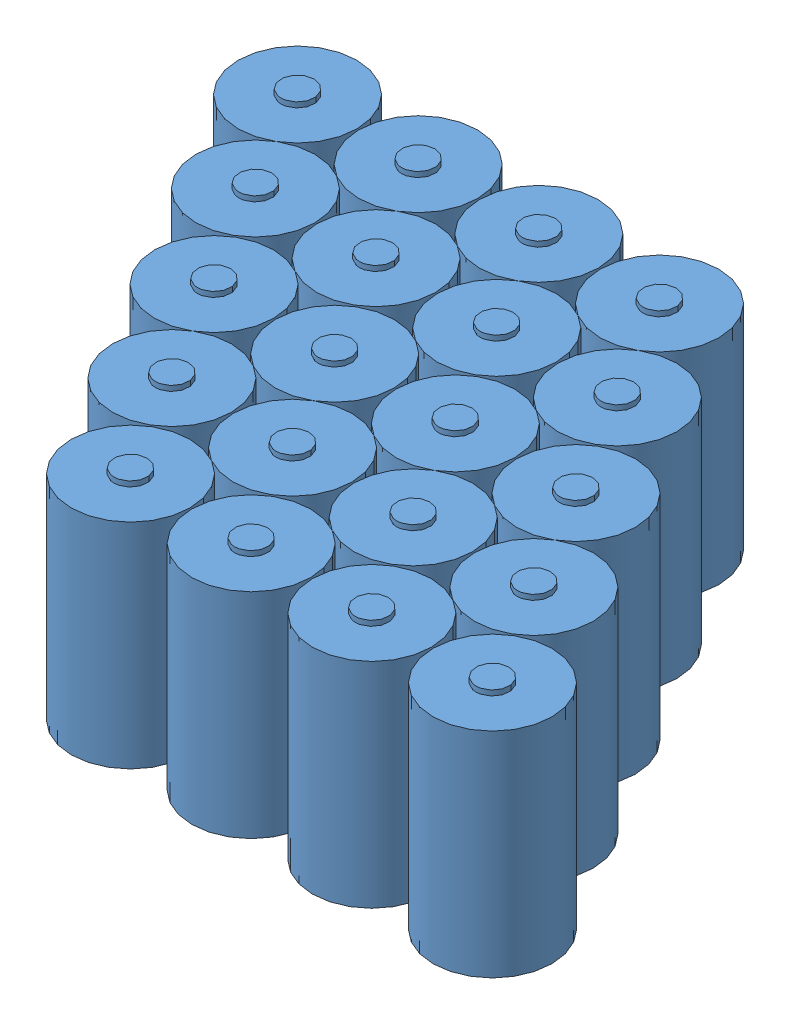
SolidWorks assembly MX1300 20 pack.SLDASM, configuration Default (file format 5000). Lengths in mm.
Overall size (208.75 63 152.66).
25 component instances, 1 part files, 19 mates.
Components (placement in the parent):
- MX1300 4 pack-1: MX1300 4 pack.SLDASM [Default] at (-237.9849 0 135.8963) size (138.32 63 34.2)
  - Duracell MX1300 Alk-1: Duracell MX1300 Alk.SLDPRT [Default] at (13.6671 0 17.1) size (34.2 63 34.2)
  - Duracell MX1300 Alk-2: Duracell MX1300 Alk.SLDPRT [Default] at (-21.0409 0 17.1) size (34.2 63 34.2)
  - Duracell MX1300 Alk-3: Duracell MX1300 Alk.SLDPRT [Default] at (-55.7489 0 17.1) size (34.2 63 34.2)
  - Duracell MX1300 Alk-4: Duracell MX1300 Alk.SLDPRT [Default] at (-90.4569 0 17.1) size (34.2 63 34.2)
- MX1300 4 pack-2: MX1300 4 pack.SLDASM [Default] at (-255.8432 0 106.1351) size (138.32 63 34.2)
  - Duracell MX1300 Alk-1: Duracell MX1300 Alk.SLDPRT [Default] at (13.6671 0 17.1) size (34.2 63 34.2)
  - Duracell MX1300 Alk-2: Duracell MX1300 Alk.SLDPRT [Default] at (-21.0409 0 17.1) size (34.2 63 34.2)
  - Duracell MX1300 Alk-3: Duracell MX1300 Alk.SLDPRT [Default] at (-55.7489 0 17.1) size (34.2 63 34.2)
  - Duracell MX1300 Alk-4: Duracell MX1300 Alk.SLDPRT [Default] at (-90.4569 0 17.1) size (34.2 63 34.2)
- MX1300 4 pack-3: MX1300 4 pack.SLDASM [Default] at (-273.1972 0 76.6652) size (138.32 63 34.2)
  - Duracell MX1300 Alk-1: Duracell MX1300 Alk.SLDPRT [Default] at (13.6671 0 17.1) size (34.2 63 34.2)
  - Duracell MX1300 Alk-2: Duracell MX1300 Alk.SLDPRT [Default] at (-21.0409 0 17.1) size (34.2 63 34.2)
  - Duracell MX1300 Alk-3: Duracell MX1300 Alk.SLDPRT [Default] at (-55.7489 0 17.1) size (34.2 63 34.2)
  - Duracell MX1300 Alk-4: Duracell MX1300 Alk.SLDPRT [Default] at (-90.4569 0 17.1) size (34.2 63 34.2)
- MX1300 4 pack-4: MX1300 4 pack.SLDASM [Default] at (-291.0555 0 46.904) size (138.32 63 34.2)
  - Duracell MX1300 Alk-1: Duracell MX1300 Alk.SLDPRT [Default] at (13.6671 0 17.1) size (34.2 63 34.2)
  - Duracell MX1300 Alk-2: Duracell MX1300 Alk.SLDPRT [Default] at (-21.0409 0 17.1) size (34.2 63 34.2)
  - Duracell MX1300 Alk-3: Duracell MX1300 Alk.SLDPRT [Default] at (-55.7489 0 17.1) size (34.2 63 34.2)
  - Duracell MX1300 Alk-4: Duracell MX1300 Alk.SLDPRT [Default] at (-90.4569 0 17.1) size (34.2 63 34.2)
- MX1300 4 pack-5: MX1300 4 pack.SLDASM [Default] at (-308.4095 0 17.434) size (138.32 63 34.2)
  - Duracell MX1300 Alk-1: Duracell MX1300 Alk.SLDPRT [Default] at (13.6671 0 17.1) size (34.2 63 34.2)
  - Duracell MX1300 Alk-2: Duracell MX1300 Alk.SLDPRT [Default] at (-21.0409 0 17.1) size (34.2 63 34.2)
  - Duracell MX1300 Alk-3: Duracell MX1300 Alk.SLDPRT [Default] at (-55.7489 0 17.1) size (34.2 63 34.2)
  - Duracell MX1300 Alk-4: Duracell MX1300 Alk.SLDPRT [Default] at (-90.4569 0 17.1) size (34.2 63 34.2)
Mates (geometry in assembly coordinates):
- Coincident2: coincident anti-aligned: plane of MX1300 4 pack-1/Duracell MX1300 Alk-1; plane of assembly
- Coincident3: coincident anti-aligned: plane of MX1300 4 pack-2/Duracell MX1300 Alk-1; plane of assembly
- Coincident4: coincident anti-aligned: plane of MX1300 4 pack-3/Duracell MX1300 Alk-1; plane of assembly
- Coincident5: coincident anti-aligned: plane of MX1300 4 pack-4/Duracell MX1300 Alk-1; plane of assembly
- Coincident6: coincident anti-aligned: plane of MX1300 4 pack-5/Duracell MX1300 Alk-1; plane of assembly
- Distance1: distance = 0.508 mm: cylinder of MX1300 4 pack-1/Duracell MX1300 Alk-1 through (-224.3178 61.5 152.9963) axis (0 -1 0) radius 17.1; cylinder of MX1300 4 pack-2/Duracell MX1300 Alk-1 through (-242.1761 61.5 123.2351) axis (0 -1 0) radius 17.1
- Tangent3: tangent anti-aligned: cylinder of MX1300 4 pack-1/Duracell MX1300 Alk-2 through (-259.0258 61.5 152.9963) axis (0 -1 0) radius 17.1; cylinder of MX1300 4 pack-2/Duracell MX1300 Alk-1 through (-242.1761 61.5 123.2351) axis (0 -1 0) radius 17.1
- Tangent5: tangent anti-aligned: cylinder of MX1300 4 pack-2/Duracell MX1300 Alk-1 through (-242.1761 61.5 123.2351) axis (0 -1 0) radius 17.1; cylinder of MX1300 4 pack-3/Duracell MX1300 Alk-1 through (-259.5301 61.5 93.7652) axis (0 -1 0) radius 17.1
- Tangent7: tangent anti-aligned: cylinder of MX1300 4 pack-2/Duracell MX1300 Alk-2 through (-276.8841 61.5 123.2351) axis (0 -1 0) radius 17.1; cylinder of MX1300 4 pack-3/Duracell MX1300 Alk-1 through (-259.5301 61.5 93.7652) axis (0 -1 0) radius 17.1
- Parallel1: parallel aligned: plane of MX1300 4 pack-1; plane of assembly
- Parallel2: parallel aligned: plane of MX1300 4 pack-2; plane of assembly
- Parallel3: parallel aligned: plane of MX1300 4 pack-3; plane of assembly
- Parallel4: parallel aligned: plane of MX1300 4 pack-3; plane of assembly
- Parallel5: parallel aligned: plane of MX1300 4 pack-4; plane of assembly
- Parallel6: parallel aligned: plane of MX1300 4 pack-5; plane of assembly
- Distance5: distance = 0.508 mm: cylinder of MX1300 4 pack-3/Duracell MX1300 Alk-1 through (-259.5301 61.5 93.7652) axis (0 -1 0) radius 17.1; cylinder of MX1300 4 pack-4/Duracell MX1300 Alk-1 through (-277.3884 61.5 64.004) axis (0 -1 0) radius 17.1
- Tangent10: tangent anti-aligned: cylinder of MX1300 4 pack-3/Duracell MX1300 Alk-2 through (-294.2381 61.5 93.7652) axis (0 -1 0) radius 17.1; cylinder of MX1300 4 pack-4/Duracell MX1300 Alk-1 through (-277.3884 61.5 64.004) axis (0 -1 0) radius 17.1
- Tangent12: tangent anti-aligned: cylinder of MX1300 4 pack-4/Duracell MX1300 Alk-1 through (-277.3884 61.5 64.004) axis (0 -1 0) radius 17.1; cylinder of MX1300 4 pack-5/Duracell MX1300 Alk-1 through (-294.7424 61.5 34.534) axis (0 -1 0) radius 17.1
- Tangent13: tangent anti-aligned: cylinder of MX1300 4 pack-4/Duracell MX1300 Alk-2 through (-312.0964 61.5 64.004) axis (0 -1 0) radius 17.1; cylinder of MX1300 4 pack-5/Duracell MX1300 Alk-1 through (-294.7424 61.5 34.534) axis (0 -1 0) radius 17.1
